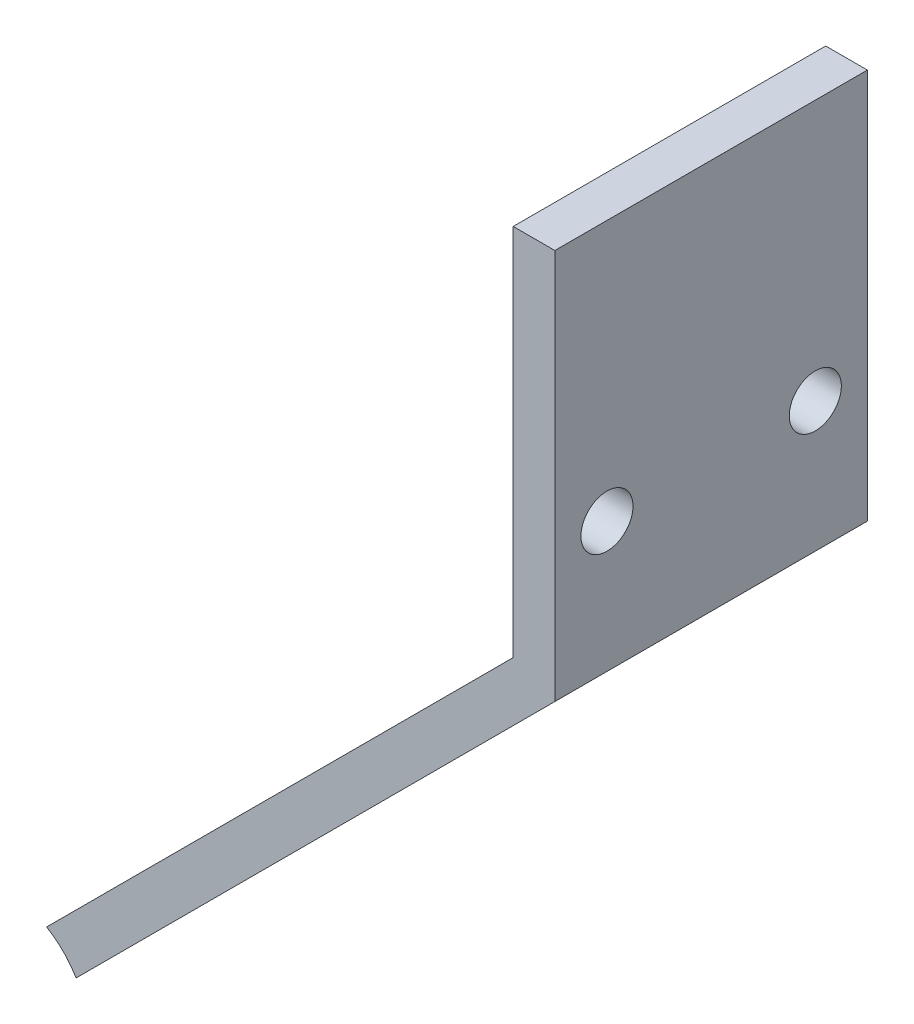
from build123d import *

# Parameters (mm, degrees)
EXTRUSION1_DEPTH        = 60
ESQUISSE2_R             = 5
ENL_V_MAT_EXTRU_1_DEPTH = 170.436272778
ESQUISSE4_R             = 16
ENL_V_MAT_EXTRU_2_DEPTH = 150


with BuildPart() as part:
    # Esquisse1 → Extrusion1 (new body)
    with BuildSketch(Plane.XY):
        Polygon((8, -32.922626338), (-83.923881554, -124.846507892), (-89.580735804, -119.189653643), (0, -29.608917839), (0, 42.077373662), (8, 42.077373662), align=None)
    extrude(amount=EXTRUSION1_DEPTH)

    # Esquisse2 → Enl_v. mat.-Extru.1 (cut, through all)
    with BuildSketch(Plane(origin=(8, 0, 0), x_dir=(0, 0, -1), z_dir=(1, 0, 0))):
        with Locations(Location((-50, -7.922626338, 0), (0, 0, 90))):
            Circle(ESQUISSE2_R)
        with Locations(Location((-10, -7.922626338, 0), (0, 0, 90))):
            Circle(ESQUISSE2_R)
    extrude(amount=-ENL_V_MAT_EXTRU_1_DEPTH, mode=Mode.SUBTRACT)

    # Esquisse4 → Enl_v. mat.-Extru.2 (cut)
    with BuildSketch(Plane.XY):
        with Locations((-97.706759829, -132.972531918)):
            Circle(ESQUISSE4_R)
    extrude(amount=ENL_V_MAT_EXTRU_2_DEPTH, mode=Mode.SUBTRACT)


solid = part.part
